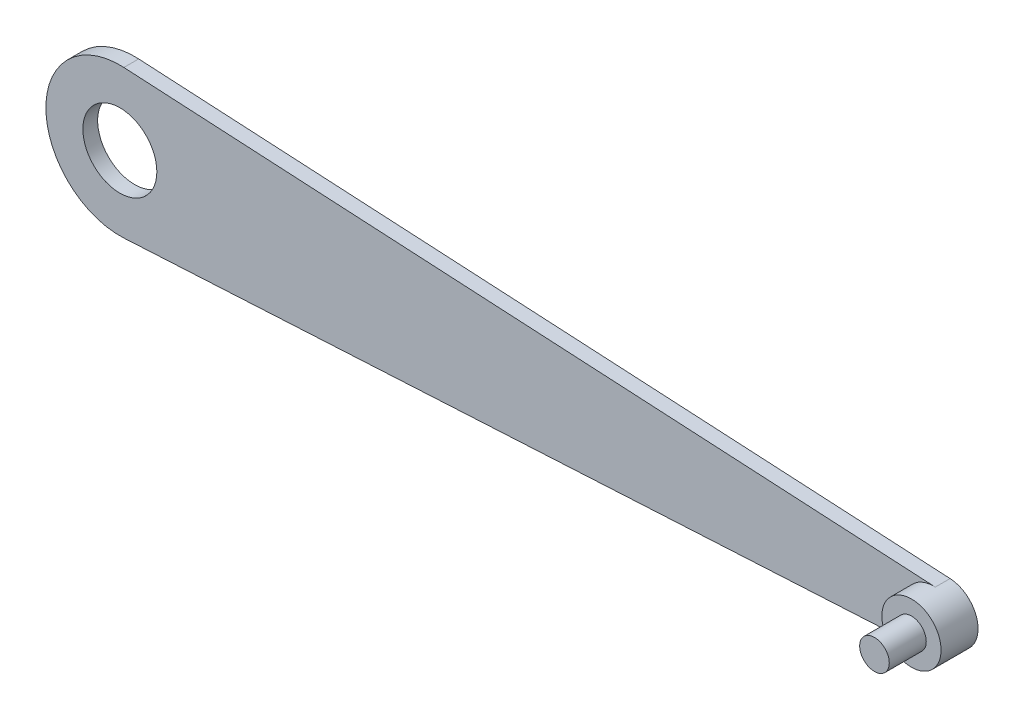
from build123d import *

# Parameters (mm, degrees)
SKETCH1_R      = 5
SKETCH1_R_2    = 2.5
EXTRUDE1_DEPTH = 1
SKETCH2_R      = 2
EXTRUDE2_DEPTH = 2.5
SKETCH3_R      = 1
EXTRUDE3_DEPTH = 2.5
EXTRUDE4_DEPTH = 1


with BuildPart() as part:
    # Sketch1 → Extrude1 (new body)
    with BuildSketch(Plane.XY):
        Circle(SKETCH1_R)
        Circle(SKETCH1_R_2, mode=Mode.SUBTRACT)
    extrude(amount=EXTRUDE1_DEPTH)



with BuildPart() as body_2:
    # Sketch2 → Extrude2 (new body)
    with BuildSketch(Plane.XY):
        with Locations((55, 0)):
            Circle(SKETCH2_R)
    extrude(amount=EXTRUDE2_DEPTH)

    # Sketch3 → Extrude3 (add)
    with BuildSketch(Plane.XY.offset(2.5)):
        with Locations((55, 0)):
            Circle(SKETCH3_R)
    extrude(amount=EXTRUDE3_DEPTH)


with BuildPart() as part_1:
    add(part.part)

    add(body_2.part)  # Extrude4 merges body 2
    # Sketch4 → Extrude4 (add)
    with BuildSketch(Plane.XY):
        with BuildLine():
            Line((0.272727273, 4.992556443), (55.109090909, 1.997022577))
            ThreePointArc((55.109090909, 1.997022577), (53, 0), (55.109090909, -1.997022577))
            Line((55.109090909, -1.997022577), (0.272727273, -4.992556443))
            ThreePointArc((0.272727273, -4.992556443), (5, 0), (0.272727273, 4.992556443))
        make_face()
    extrude(amount=EXTRUDE4_DEPTH)


solid = part_1.part
